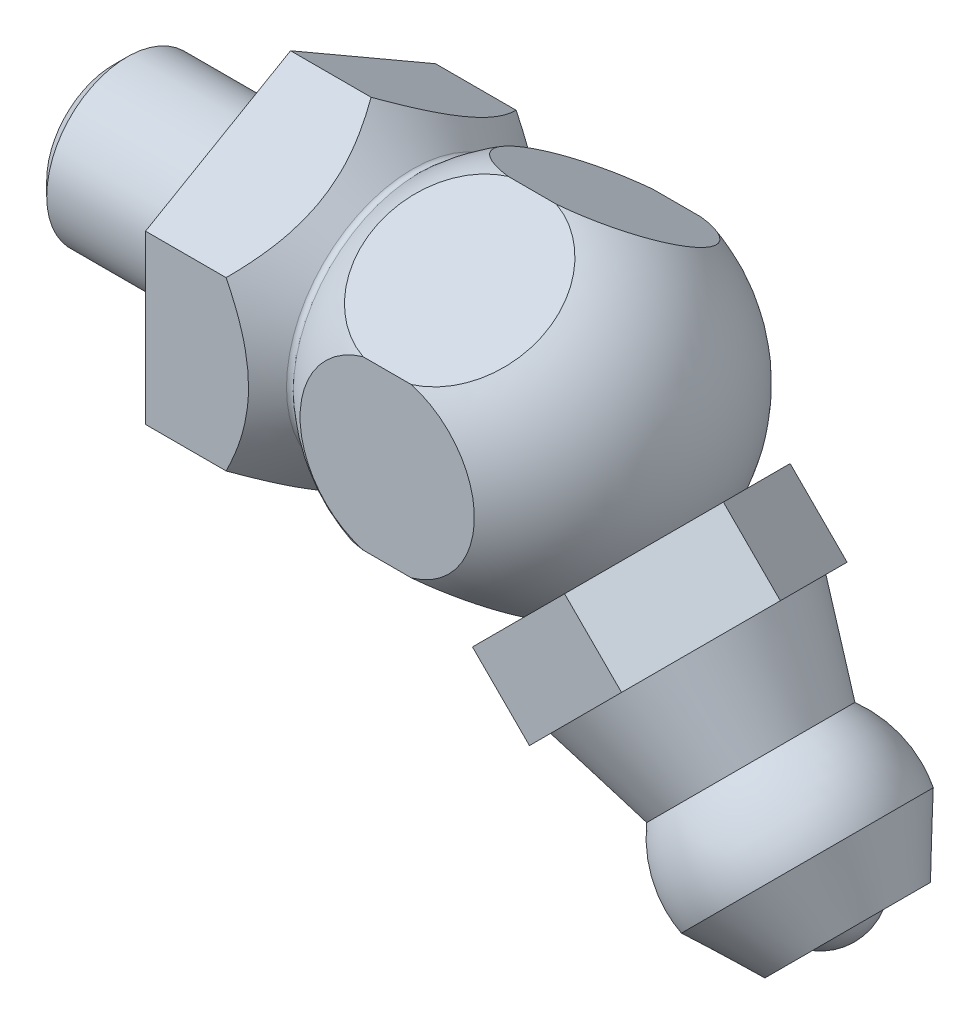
ISO-10303-21;
HEADER;
FILE_DESCRIPTION(('STEP AP214'),'2;1');
FILE_NAME('part.step','',(''),(''),'','','');
FILE_SCHEMA(('AUTOMOTIVE_DESIGN { 1 0 10303 214 1 1 1 1 }'));
ENDSEC;
DATA;
#1=APPLICATION_CONTEXT('core data for automotive mechanical design processes');
#2=APPLICATION_PROTOCOL_DEFINITION('international standard','automotive_design',2000,#1);
#3=PRODUCT_CONTEXT('',#1,'mechanical');
#4=PRODUCT('Part','Part','',(#3));
#5=PRODUCT_RELATED_PRODUCT_CATEGORY('part','',(#4));
#6=PRODUCT_DEFINITION_FORMATION('','',#4);
#7=PRODUCT_DEFINITION_CONTEXT('part definition',#1,'design');
#8=PRODUCT_DEFINITION('design','',#6,#7);
#9=PRODUCT_DEFINITION_SHAPE('','',#8);
#10=(LENGTH_UNIT() NAMED_UNIT(*) SI_UNIT(.MILLI.,.METRE.));
#11=(NAMED_UNIT(*) PLANE_ANGLE_UNIT() SI_UNIT($,.RADIAN.));
#12=(NAMED_UNIT(*) SI_UNIT($,.STERADIAN.) SOLID_ANGLE_UNIT());
#13=UNCERTAINTY_MEASURE_WITH_UNIT(LENGTH_MEASURE(1.E-05),#10,'distance_accuracy_value','');
#14=(GEOMETRIC_REPRESENTATION_CONTEXT(3) GLOBAL_UNCERTAINTY_ASSIGNED_CONTEXT((#13)) GLOBAL_UNIT_ASSIGNED_CONTEXT((#10,
#11,#12)) REPRESENTATION_CONTEXT('',''));
#15=CARTESIAN_POINT('',(0.,0.,0.));
#16=DIRECTION('',(0.,0.,1.));
#17=DIRECTION('',(1.,0.,0.));
#18=AXIS2_PLACEMENT_3D('',#15,#16,#17);
#19=CARTESIAN_POINT('',(7.5,0.,0.));
#20=DIRECTION('',(-1.,0.,0.));
#21=DIRECTION('',(0.,1.,0.));
#22=AXIS2_PLACEMENT_3D('',#19,#20,#21);
#23=SPHERICAL_SURFACE('',#22,5.25);
#24=CARTESIAN_POINT('',(7.5,-3.89711431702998,2.25));
#25=DIRECTION('',(0.,0.866025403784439,-0.5));
#26=DIRECTION('',(0.,0.5,0.866025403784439));
#27=AXIS2_PLACEMENT_3D('',#24,#25,#26);
#28=CIRCLE('',#27,2.70416345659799);
#29=CARTESIAN_POINT('',(8.25,-2.59807621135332,4.5));
#30=VERTEX_POINT('',#29);
#31=CARTESIAN_POINT('',(10.1090626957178,-3.54169489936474,2.86560448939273));
#32=VERTEX_POINT('',#31);
#33=EDGE_CURVE('E426',#30,#32,#28,.T.);
#34=ORIENTED_EDGE('',*,*,#33,.T.);
#35=CARTESIAN_POINT('',(10.5753787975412,-3.07537879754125,0.));
#36=DIRECTION('',(-0.707106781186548,0.707106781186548,0.));
#37=DIRECTION('',(-0.707106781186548,-0.707106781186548,0.));
#38=AXIS2_PLACEMENT_3D('',#35,#36,#37);
#39=CIRCLE('',#38,2.94050854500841);
#40=CARTESIAN_POINT('',(10.1090626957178,-3.54169489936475,-2.86560448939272));
#41=VERTEX_POINT('',#40);
#42=EDGE_CURVE('E212',#32,#41,#39,.T.);
#43=ORIENTED_EDGE('',*,*,#42,.T.);
#44=CARTESIAN_POINT('',(7.5,-3.89711431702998,-2.25));
#45=DIRECTION('',(0.,0.866025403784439,0.5));
#46=DIRECTION('',(0.,-0.5,0.866025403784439));
#47=AXIS2_PLACEMENT_3D('',#44,#45,#46);
#48=CIRCLE('',#47,2.70416345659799);
#49=CARTESIAN_POINT('',(8.25,-2.59807621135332,-4.5));
#50=VERTEX_POINT('',#49);
#51=EDGE_CURVE('E287',#41,#50,#48,.T.);
#52=ORIENTED_EDGE('',*,*,#51,.T.);
#53=CARTESIAN_POINT('',(7.5,0.,-4.5));
#54=DIRECTION('',(0.,0.,1.));
#55=DIRECTION('',(0.,-1.,0.));
#56=AXIS2_PLACEMENT_3D('',#53,#54,#55);
#57=CIRCLE('',#56,2.70416345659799);
#58=CARTESIAN_POINT('',(8.25,2.59807621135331,-4.5));
#59=VERTEX_POINT('',#58);
#60=EDGE_CURVE('E273',#50,#59,#57,.T.);
#61=ORIENTED_EDGE('',*,*,#60,.T.);
#62=CARTESIAN_POINT('',(7.5,3.89711431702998,-2.25));
#63=DIRECTION('',(0.,-0.866025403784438,0.5));
#64=DIRECTION('',(0.,-0.5,-0.866025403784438));
#65=AXIS2_PLACEMENT_3D('',#62,#63,#64);
#66=CIRCLE('',#65,2.70416345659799);
#67=CARTESIAN_POINT('',(8.25,5.19615242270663,0.));
#68=VERTEX_POINT('',#67);
#69=EDGE_CURVE('E38',#59,#68,#66,.T.);
#70=ORIENTED_EDGE('',*,*,#69,.T.);
#71=CARTESIAN_POINT('',(7.5,3.89711431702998,2.25));
#72=DIRECTION('',(0.,-0.866025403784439,-0.5));
#73=DIRECTION('',(0.,0.5,-0.866025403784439));
#74=AXIS2_PLACEMENT_3D('',#71,#72,#73);
#75=CIRCLE('',#74,2.70416345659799);
#76=CARTESIAN_POINT('',(8.25,2.59807621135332,4.5));
#77=VERTEX_POINT('',#76);
#78=EDGE_CURVE('E357',#68,#77,#75,.T.);
#79=ORIENTED_EDGE('',*,*,#78,.T.);
#80=CARTESIAN_POINT('',(7.5,0.,4.5));
#81=DIRECTION('',(0.,0.,-1.));
#82=DIRECTION('',(0.,1.,0.));
#83=AXIS2_PLACEMENT_3D('',#80,#81,#82);
#84=CIRCLE('',#83,2.70416345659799);
#85=EDGE_CURVE('E333',#77,#30,#84,.T.);
#86=ORIENTED_EDGE('',*,*,#85,.T.);
#87=EDGE_LOOP('',(#34,#43,#52,#61,#70,#79,#86));
#88=FACE_BOUND('',#87,.T.);
#89=ADVANCED_FACE('F15',(#88),#23,.T.);
#90=CARTESIAN_POINT('',(8.25,-5.19615242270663,0.));
#91=VERTEX_POINT('',#90);
#92=CARTESIAN_POINT('',(8.49676654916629,-5.15399104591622,-0.0730256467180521));
#93=VERTEX_POINT('',#92);
#94=EDGE_CURVE('E282',#91,#93,#48,.T.);
#95=ORIENTED_EDGE('',*,*,#94,.T.);
#96=CARTESIAN_POINT('',(8.49676654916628,-5.15399104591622,0.0730256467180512));
#97=VERTEX_POINT('',#96);
#98=EDGE_CURVE('E31',#93,#97,#39,.T.);
#99=ORIENTED_EDGE('',*,*,#98,.T.);
#100=EDGE_CURVE('E424',#97,#91,#28,.T.);
#101=ORIENTED_EDGE('',*,*,#100,.T.);
#102=EDGE_LOOP('',(#95,#99,#101));
#103=FACE_BOUND('',#102,.T.);
#104=ADVANCED_FACE('F458',(#103),#23,.T.);
#105=CARTESIAN_POINT('',(6.75,2.59807621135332,4.5));
#106=VERTEX_POINT('',#105);
#107=CARTESIAN_POINT('',(6.75,5.19615242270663,0.));
#108=VERTEX_POINT('',#107);
#109=EDGE_CURVE('E358',#106,#108,#75,.T.);
#110=ORIENTED_EDGE('',*,*,#109,.T.);
#111=CARTESIAN_POINT('',(6.75,2.59807621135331,-4.5));
#112=VERTEX_POINT('',#111);
#113=EDGE_CURVE('E220',#108,#112,#66,.T.);
#114=ORIENTED_EDGE('',*,*,#113,.T.);
#115=CARTESIAN_POINT('',(6.75,-2.59807621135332,-4.5));
#116=VERTEX_POINT('',#115);
#117=EDGE_CURVE('E272',#112,#116,#57,.T.);
#118=ORIENTED_EDGE('',*,*,#117,.T.);
#119=CARTESIAN_POINT('',(6.75,-5.19615242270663,0.));
#120=VERTEX_POINT('',#119);
#121=EDGE_CURVE('E281',#116,#120,#48,.T.);
#122=ORIENTED_EDGE('',*,*,#121,.T.);
#123=CARTESIAN_POINT('',(6.75,-2.59807621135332,4.5));
#124=VERTEX_POINT('',#123);
#125=EDGE_CURVE('E415',#120,#124,#28,.T.);
#126=ORIENTED_EDGE('',*,*,#125,.T.);
#127=EDGE_CURVE('E438',#124,#106,#84,.T.);
#128=ORIENTED_EDGE('',*,*,#127,.T.);
#129=EDGE_LOOP('',(#110,#114,#118,#122,#126,#128));
#130=FACE_BOUND('',#129,.T.);
#131=CARTESIAN_POINT('',(3.99147025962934,0.,0.));
#132=DIRECTION('',(-1.,0.,0.));
#133=DIRECTION('',(0.,0.,1.));
#134=AXIS2_PLACEMENT_3D('',#131,#132,#133);
#135=CIRCLE('',#134,3.90547296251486);
#136=CARTESIAN_POINT('',(3.99147025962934,0.,3.90547296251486));
#137=VERTEX_POINT('',#136);
#138=EDGE_CURVE('E378',#137,#137,#135,.T.);
#139=ORIENTED_EDGE('',*,*,#138,.F.);
#140=EDGE_LOOP('',(#139));
#141=FACE_BOUND('',#140,.T.);
#142=ADVANCED_FACE('F17',(#130,#141),#23,.T.);
#143=CARTESIAN_POINT('',(3.89122655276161,0.,0.));
#144=DIRECTION('',(-1.,0.,0.));
#145=DIRECTION('',(0.,0.,1.));
#146=AXIS2_PLACEMENT_3D('',#143,#144,#145);
#147=TOROIDAL_SURFACE('',#146,4.017057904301,0.15);
#148=ORIENTED_EDGE('',*,*,#138,.T.);
#149=EDGE_LOOP('',(#148));
#150=FACE_BOUND('',#149,.T.);
#151=CARTESIAN_POINT('',(3.78516053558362,0.,0.));
#152=DIRECTION('',(-1.,0.,0.));
#153=DIRECTION('',(0.,0.,1.));
#154=AXIS2_PLACEMENT_3D('',#151,#152,#153);
#155=CIRCLE('',#154,3.91099188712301);
#156=CARTESIAN_POINT('',(3.78516053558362,0.,3.91099188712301));
#157=VERTEX_POINT('',#156);
#158=EDGE_CURVE('E374',#157,#157,#155,.T.);
#159=ORIENTED_EDGE('',*,*,#158,.F.);
#160=EDGE_LOOP('',(#159));
#161=FACE_BOUND('',#160,.T.);
#162=ADVANCED_FACE('F464',(#150,#161),#147,.F.);
#163=CARTESIAN_POINT('',(2.5,0.,0.));
#164=DIRECTION('',(-1.,0.,0.));
#165=DIRECTION('',(0.,0.,1.));
#166=AXIS2_PLACEMENT_3D('',#163,#164,#165);
#167=CONICAL_SURFACE('',#166,5.19615242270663,0.785398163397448);
#168=CARTESIAN_POINT('',(2.499998,5.19615442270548,3.4640996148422E-06));
#169=CARTESIAN_POINT('',(2.54466103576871,5.15148473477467,-0.0773667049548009));
#170=CARTESIAN_POINT('',(2.58795334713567,5.10647170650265,-0.155331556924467));
#171=CARTESIAN_POINT('',(2.67137958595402,5.01569162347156,-0.312567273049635));
#172=CARTESIAN_POINT('',(2.71151178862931,4.96992417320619,-0.391838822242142));
#173=CARTESIAN_POINT('',(2.82688498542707,4.83096407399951,-0.632524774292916));
#174=CARTESIAN_POINT('',(2.8966104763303,4.73659513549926,-0.7959765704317));
#175=CARTESIAN_POINT('',(3.01601019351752,4.54629268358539,-1.12559008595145));
#176=CARTESIAN_POINT('',(3.06598519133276,4.45040779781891,-1.29166757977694));
#177=CARTESIAN_POINT('',(3.12379369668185,4.30500427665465,-1.54351386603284));
#178=CARTESIAN_POINT('',(3.14019647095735,4.25632238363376,-1.62783337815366));
#179=CARTESIAN_POINT('',(3.16691288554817,4.15854645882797,-1.79718624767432));
#180=CARTESIAN_POINT('',(3.17722743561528,4.10945248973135,-1.88221949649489));
#181=CARTESIAN_POINT('',(3.19452170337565,3.98981307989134,-2.08944103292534));
#182=CARTESIAN_POINT('',(3.19814986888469,3.91913872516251,-2.21185260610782));
#183=CARTESIAN_POINT('',(3.19205689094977,3.77791744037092,-2.45645504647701));
#184=CARTESIAN_POINT('',(3.18233106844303,3.70737056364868,-2.57864582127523));
#185=CARTESIAN_POINT('',(3.15010341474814,3.5669419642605,-2.82187529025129));
#186=CARTESIAN_POINT('',(3.12758729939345,3.49706107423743,-2.94291254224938));
#187=CARTESIAN_POINT('',(3.07100316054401,3.35850039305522,-3.18290668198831));
#188=CARTESIAN_POINT('',(3.03693602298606,3.28982051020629,-3.30186372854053));
#189=CARTESIAN_POINT('',(2.96685446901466,3.16790964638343,-3.51301953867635));
#190=CARTESIAN_POINT('',(2.93268420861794,3.11440855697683,-3.60568614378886));
#191=CARTESIAN_POINT('',(2.85883804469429,3.00836663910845,-3.78935613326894));
#192=CARTESIAN_POINT('',(2.81916197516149,2.95582583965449,-3.88035946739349));
#193=CARTESIAN_POINT('',(2.73519338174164,2.85187000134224,-4.06041626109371));
#194=CARTESIAN_POINT('',(2.69091537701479,2.8004520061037,-4.1494748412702));
#195=CARTESIAN_POINT('',(2.59832404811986,2.69856798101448,-4.32594314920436));
#196=CARTESIAN_POINT('',(2.55001319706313,2.64810139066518,-4.4133538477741));
#197=CARTESIAN_POINT('',(2.49999884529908,2.59807505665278,-4.500002));
#198=B_SPLINE_CURVE_WITH_KNOTS('',3,(#168,#169,#170,#171,#172,#173,#174,#175,#176,#177,#178,
#179,#180,#181,#182,#183,#184,#185,#186,#187,#188,#189,#190,#191,#192,#193,#194,#195,#196,#197),
.UNSPECIFIED.,.F.,.F.,(4,2,2,2,2,2,2,2,2,2,2,2,2,2,4),(0.,0.299626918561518,0.599416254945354,
1.20223089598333,1.79547485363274,2.09151514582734,2.3875111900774,2.81103790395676,
3.23471305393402,3.65886229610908,4.08297901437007,4.41979820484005,4.75662755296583,
5.09242472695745,5.42801746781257),.UNSPECIFIED.);
#199=CARTESIAN_POINT('',(2.49999999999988,5.19615242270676,2.09672024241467E-13));
#200=VERTEX_POINT('',#199);
#201=CARTESIAN_POINT('',(2.5,2.59807621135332,-4.5));
#202=VERTEX_POINT('',#201);
#203=EDGE_CURVE('E228',#200,#202,#198,.T.);
#204=ORIENTED_EDGE('',*,*,#203,.F.);
#205=CARTESIAN_POINT('',(2.499998,2.59807421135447,4.50000346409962));
#206=CARTESIAN_POINT('',(2.54466103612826,2.64274389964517,4.42263329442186));
#207=CARTESIAN_POINT('',(2.58795334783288,2.68775692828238,4.34466844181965));
#208=CARTESIAN_POINT('',(2.6713795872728,2.77853701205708,4.18743272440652));
#209=CARTESIAN_POINT('',(2.71151179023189,2.82430446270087,4.10816117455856));
#210=CARTESIAN_POINT('',(2.8268849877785,2.96326456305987,3.86747522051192));
#211=CARTESIAN_POINT('',(2.89661047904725,3.05763350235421,3.70402342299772));
#212=CARTESIAN_POINT('',(3.01601019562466,3.24793595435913,3.37440990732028));
#213=CARTESIAN_POINT('',(3.06598519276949,3.34382083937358,3.20833241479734));
#214=CARTESIAN_POINT('',(3.12379369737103,3.4892243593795,2.95648613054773));
#215=CARTESIAN_POINT('',(3.14019647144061,3.53790625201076,2.87216661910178));
#216=CARTESIAN_POINT('',(3.16691288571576,3.63568217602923,2.7028137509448));
#217=CARTESIAN_POINT('',(3.17722743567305,3.68477614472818,2.61778050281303));
#218=CARTESIAN_POINT('',(3.19452170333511,3.80441555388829,2.41055896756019));
#219=CARTESIAN_POINT('',(3.19814986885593,3.875089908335,2.28814739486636));
#220=CARTESIAN_POINT('',(3.19205689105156,4.01631119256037,2.04354495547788));
#221=CARTESIAN_POINT('',(3.18233106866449,4.08685806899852,1.92135418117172));
#222=CARTESIAN_POINT('',(3.15010341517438,4.2272866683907,1.67812471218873));
#223=CARTESIAN_POINT('',(3.12758729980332,4.29716755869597,1.55708745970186));
#224=CARTESIAN_POINT('',(3.07100316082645,4.43572824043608,1.31709331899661));
#225=CARTESIAN_POINT('',(3.03693602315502,4.50440812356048,1.19813627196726));
#226=CARTESIAN_POINT('',(2.96685442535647,4.62631906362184,0.986980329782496));
#227=CARTESIAN_POINT('',(2.93268411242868,4.67982022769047,0.894313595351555));
#228=CARTESIAN_POINT('',(2.85883782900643,4.7858622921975,0.710643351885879));
#229=CARTESIAN_POINT('',(2.81916169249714,4.83840316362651,0.61963989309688));
#230=CARTESIAN_POINT('',(2.73519295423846,4.94235914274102,0.439582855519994));
#231=CARTESIAN_POINT('',(2.69091487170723,4.99377720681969,0.350524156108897));
#232=CARTESIAN_POINT('',(2.59832337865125,5.09566136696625,0.17405561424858));
#233=CARTESIAN_POINT('',(2.55001244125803,5.14612802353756,0.0866448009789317));
#234=CARTESIAN_POINT('',(2.499998,5.19615442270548,-3.46409961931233E-06));
#235=B_SPLINE_CURVE_WITH_KNOTS('',3,(#205,#206,#207,#208,#209,#210,#211,#212,#213,#214,#215,
#216,#217,#218,#219,#220,#221,#222,#223,#224,#225,#226,#227,#228,#229,#230,#231,#232,#233,#234),
.UNSPECIFIED.,.F.,.F.,(4,2,2,2,2,2,2,2,2,2,2,2,2,2,4),(0.,0.299626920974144,0.599416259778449,
1.20223090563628,1.79547485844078,2.0915151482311,2.38751119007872,2.8110379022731,
3.23471305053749,3.65886229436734,4.0829790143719,4.4197986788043,4.75662850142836,
5.09242614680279,5.42801935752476),.UNSPECIFIED.);
#236=CARTESIAN_POINT('',(2.5,2.59807621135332,4.5));
#237=VERTEX_POINT('',#236);
#238=EDGE_CURVE('E346',#237,#200,#235,.T.);
#239=ORIENTED_EDGE('',*,*,#238,.F.);
#240=CARTESIAN_POINT('',(-1.45485826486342,-7.96812378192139,4.5));
#241=CARTESIAN_POINT('',(-1.28869375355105,-7.77725517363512,4.5));
#242=CARTESIAN_POINT('',(-1.1233118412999,-7.58569726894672,4.5));
#243=CARTESIAN_POINT('',(-0.794537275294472,-7.20083140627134,4.5));
#244=CARTESIAN_POINT('',(-0.631144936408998,-7.00752317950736,4.5));
#245=CARTESIAN_POINT('',(-0.305739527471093,-6.61754282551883,4.5));
#246=CARTESIAN_POINT('',(-0.143743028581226,-6.42085683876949,4.5));
#247=CARTESIAN_POINT('',(0.177083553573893,-6.02493702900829,4.5));
#248=CARTESIAN_POINT('',(0.335913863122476,-5.8257033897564,4.5));
#249=CARTESIAN_POINT('',(0.66230234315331,-5.40772425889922,4.5));
#250=CARTESIAN_POINT('',(0.829518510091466,-5.1887106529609,4.5));
#251=CARTESIAN_POINT('',(1.15767633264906,-4.74592442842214,4.5));
#252=CARTESIAN_POINT('',(1.31861651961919,-4.52215071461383,4.5));
#253=CARTESIAN_POINT('',(1.63135833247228,-4.06921563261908,4.5));
#254=CARTESIAN_POINT('',(1.78318485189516,-3.84007156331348,4.5));
#255=CARTESIAN_POINT('',(2.07459012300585,-3.37417678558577,4.5));
#256=CARTESIAN_POINT('',(2.2141759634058,-3.13743058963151,4.5));
#257=CARTESIAN_POINT('',(2.43178162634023,-2.73527818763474,4.5));
#258=CARTESIAN_POINT('',(2.51475232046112,-2.57256574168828,4.5));
#259=CARTESIAN_POINT('',(2.67057257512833,-2.24224886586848,4.5));
#260=CARTESIAN_POINT('',(2.74341944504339,-2.0746431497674,4.5));
#261=CARTESIAN_POINT('',(2.87520845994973,-1.73649389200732,4.5));
#262=CARTESIAN_POINT('',(2.93431932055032,-1.56601702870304,4.5));
#263=CARTESIAN_POINT('',(3.0365403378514,-1.22031200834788,4.5));
#264=CARTESIAN_POINT('',(3.07965929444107,-1.04508652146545,4.5));
#265=CARTESIAN_POINT('',(3.13829719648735,-0.735522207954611,4.5));
#266=CARTESIAN_POINT('',(3.15802989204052,-0.601981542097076,4.5));
#267=CARTESIAN_POINT('',(3.18576796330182,-0.333688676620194,4.5));
#268=CARTESIAN_POINT('',(3.19377569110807,-0.19893672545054,4.5));
#269=CARTESIAN_POINT('',(3.19761516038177,0.070668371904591,4.5));
#270=CARTESIAN_POINT('',(3.19345365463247,0.205521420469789,4.5));
#271=CARTESIAN_POINT('',(3.17320972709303,0.474334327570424,4.5));
#272=CARTESIAN_POINT('',(3.15712506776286,0.608294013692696,4.5));
#273=CARTESIAN_POINT('',(3.10806847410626,0.910056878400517,4.5));
#274=CARTESIAN_POINT('',(3.07172679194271,1.07731216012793,4.5));
#275=CARTESIAN_POINT('',(2.98379657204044,1.40774085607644,4.5));
#276=CARTESIAN_POINT('',(2.93220131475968,1.57091243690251,4.5));
#277=CARTESIAN_POINT('',(2.81578475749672,1.89504915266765,4.5));
#278=CARTESIAN_POINT('',(2.75078499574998,2.05594943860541,4.5));
#279=CARTESIAN_POINT('',(2.64572744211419,2.2938718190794,4.5));
#280=CARTESIAN_POINT('',(2.60945179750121,2.3726018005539,4.5));
#281=CARTESIAN_POINT('',(2.53465428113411,2.52898752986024,4.5));
#282=CARTESIAN_POINT('',(2.49613245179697,2.60664329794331,4.5));
#283=CARTESIAN_POINT('',(2.38648020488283,2.82072066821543,4.5));
#284=CARTESIAN_POINT('',(2.31321311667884,2.95604877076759,4.5));
#285=CARTESIAN_POINT('',(2.1616197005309,3.22385377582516,4.5));
#286=CARTESIAN_POINT('',(2.08329235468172,3.35633009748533,4.5));
#287=CARTESIAN_POINT('',(1.92247755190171,3.61885290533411,4.5));
#288=CARTESIAN_POINT('',(1.83998720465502,3.74889761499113,4.5));
#289=CARTESIAN_POINT('',(1.67163238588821,4.00678946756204,4.5));
#290=CARTESIAN_POINT('',(1.58576765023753,4.13463643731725,4.5));
#291=CARTESIAN_POINT('',(1.32330763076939,4.51636346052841,4.5));
#292=CARTESIAN_POINT('',(1.14251641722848,4.76735794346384,4.5));
#293=CARTESIAN_POINT('',(0.773264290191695,5.26342980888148,4.5));
#294=CARTESIAN_POINT('',(0.584806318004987,5.5085094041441,4.5));
#295=CARTESIAN_POINT('',(0.219834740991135,5.97191439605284,4.5));
#296=CARTESIAN_POINT('',(0.0438141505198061,6.19062941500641,4.5));
#297=CARTESIAN_POINT('',(-0.31179879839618,6.62516814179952,4.5));
#298=CARTESIAN_POINT('',(-0.491391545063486,6.84099153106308,4.5));
#299=CARTESIAN_POINT('',(-0.85165352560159,7.26829396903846,4.5));
#300=CARTESIAN_POINT('',(-1.03229702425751,7.47979476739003,4.5));
#301=CARTESIAN_POINT('',(-1.39574054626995,7.9008620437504,4.5));
#302=CARTESIAN_POINT('',(-1.57854012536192,8.11042890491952,4.5));
#303=CARTESIAN_POINT('',(-1.76217480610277,8.31925200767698,4.5));
#304=B_SPLINE_CURVE_WITH_KNOTS('',3,(#240,#241,#242,#243,#244,#245,#246,#247,#248,#249,#250,
#251,#252,#253,#254,#255,#256,#257,#258,#259,#260,#261,#262,#263,#264,#265,#266,#267,#268,#269,
#270,#271,#272,#273,#274,#275,#276,#277,#278,#279,#280,#281,#282,#283,#284,#285,#286,#287,#288,
#289,#290,#291,#292,#293,#294,#295,#296,#297,#298,#299,#300,#301,#302,#303),.UNSPECIFIED.,.F.,
.F.,(4,2,2,2,2,2,2,2,2,2,2,2,2,2,2,2,2,2,2,2,2,2,2,2,2,2,2,2,2,2,2,4),(0.,0.759199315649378,
1.51851725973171,2.28292165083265,3.04727121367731,3.87384097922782,4.70060302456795,
5.52499311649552,6.34890259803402,6.89657776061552,7.44439820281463,7.98508487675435,
8.52547358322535,8.92998027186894,9.334405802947,9.73860695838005,10.142883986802,
10.6554692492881,11.168280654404,11.6884200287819,11.9484482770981,12.2084716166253,
12.66999204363,13.1316055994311,13.593544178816,14.0555189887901,14.9832563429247,
15.91064107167,16.7528376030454,17.5951261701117,18.4295451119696,19.2637950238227),.UNSPECIFIED.);
#305=CARTESIAN_POINT('',(2.5,-2.59807621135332,4.5));
#306=VERTEX_POINT('',#305);
#307=EDGE_CURVE('E325',#306,#237,#304,.T.);
#308=ORIENTED_EDGE('',*,*,#307,.F.);
#309=CARTESIAN_POINT('',(2.499998,-5.19615442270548,-3.46409961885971E-06));
#310=CARTESIAN_POINT('',(2.54466103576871,-5.15148473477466,0.0773667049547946));
#311=CARTESIAN_POINT('',(2.58795334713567,-5.10647170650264,0.15533155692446));
#312=CARTESIAN_POINT('',(2.67137958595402,-5.01569162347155,0.312567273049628));
#313=CARTESIAN_POINT('',(2.71151178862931,-4.96992417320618,0.391838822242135));
#314=CARTESIAN_POINT('',(2.82688498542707,-4.83096407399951,0.632524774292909));
#315=CARTESIAN_POINT('',(2.89661047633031,-4.73659513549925,0.795976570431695));
#316=CARTESIAN_POINT('',(3.01601019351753,-4.54629268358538,1.12559008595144));
#317=CARTESIAN_POINT('',(3.06598519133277,-4.4504077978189,1.29166757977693));
#318=CARTESIAN_POINT('',(3.12379369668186,-4.30500427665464,1.54351386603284));
#319=CARTESIAN_POINT('',(3.14019647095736,-4.25632238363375,1.62783337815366));
#320=CARTESIAN_POINT('',(3.16691288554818,-4.15854645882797,1.79718624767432));
#321=CARTESIAN_POINT('',(3.17722743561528,-4.10945248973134,1.88221949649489));
#322=CARTESIAN_POINT('',(3.19452170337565,-3.98981307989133,2.08944103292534));
#323=CARTESIAN_POINT('',(3.1981498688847,-3.9191387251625,2.21185260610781));
#324=CARTESIAN_POINT('',(3.19205689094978,-3.77791744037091,2.45645504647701));
#325=CARTESIAN_POINT('',(3.18233106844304,-3.70737056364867,2.57864582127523));
#326=CARTESIAN_POINT('',(3.15010341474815,-3.56694196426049,2.82187529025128));
#327=CARTESIAN_POINT('',(3.12758729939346,-3.49706107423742,2.94291254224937));
#328=CARTESIAN_POINT('',(3.07100316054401,-3.35850039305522,3.1829066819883));
#329=CARTESIAN_POINT('',(3.03693602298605,-3.2898205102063,3.30186372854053));
#330=CARTESIAN_POINT('',(2.96685446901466,-3.16790964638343,3.51301953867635));
#331=CARTESIAN_POINT('',(2.93268420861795,-3.11440855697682,3.60568614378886));
#332=CARTESIAN_POINT('',(2.85883804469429,-3.00836663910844,3.78935613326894));
#333=CARTESIAN_POINT('',(2.8191619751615,-2.95582583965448,3.88035946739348));
#334=CARTESIAN_POINT('',(2.73519338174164,-2.85187000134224,4.06041626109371));
#335=CARTESIAN_POINT('',(2.69091537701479,-2.8004520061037,4.1494748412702));
#336=CARTESIAN_POINT('',(2.59832404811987,-2.69856798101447,4.32594314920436));
#337=CARTESIAN_POINT('',(2.55001319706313,-2.64810139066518,4.4133538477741));
#338=CARTESIAN_POINT('',(2.49999884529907,-2.59807505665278,4.500002));
#339=B_SPLINE_CURVE_WITH_KNOTS('',3,(#309,#310,#311,#312,#313,#314,#315,#316,#317,#318,#319,
#320,#321,#322,#323,#324,#325,#326,#327,#328,#329,#330,#331,#332,#333,#334,#335,#336,#337,#338),
.UNSPECIFIED.,.F.,.F.,(4,2,2,2,2,2,2,2,2,2,2,2,2,2,4),(0.,0.29962691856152,0.599416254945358,
1.20223089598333,1.79547485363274,2.09151514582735,2.38751119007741,2.81103790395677,
3.23471305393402,3.65886229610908,4.08297901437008,4.41979820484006,4.75662755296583,
5.09242472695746,5.42801746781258),.UNSPECIFIED.);
#340=CARTESIAN_POINT('',(2.5,-5.19615242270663,0.));
#341=VERTEX_POINT('',#340);
#342=EDGE_CURVE('E301',#341,#306,#339,.T.);
#343=ORIENTED_EDGE('',*,*,#342,.F.);
#344=CARTESIAN_POINT('',(2.499998,-2.59807421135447,-4.50000346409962));
#345=CARTESIAN_POINT('',(2.54466103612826,-2.64274389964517,-4.42263329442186));
#346=CARTESIAN_POINT('',(2.58795334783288,-2.68775692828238,-4.34466844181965));
#347=CARTESIAN_POINT('',(2.6713795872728,-2.77853701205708,-4.18743272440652));
#348=CARTESIAN_POINT('',(2.71151179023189,-2.82430446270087,-4.10816117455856));
#349=CARTESIAN_POINT('',(2.8268849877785,-2.96326456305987,-3.86747522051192));
#350=CARTESIAN_POINT('',(2.89661047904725,-3.05763350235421,-3.70402342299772));
#351=CARTESIAN_POINT('',(3.01601019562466,-3.24793595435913,-3.37440990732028));
#352=CARTESIAN_POINT('',(3.06598519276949,-3.34382083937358,-3.20833241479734));
#353=CARTESIAN_POINT('',(3.12379369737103,-3.4892243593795,-2.95648613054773));
#354=CARTESIAN_POINT('',(3.14019647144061,-3.53790625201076,-2.87216661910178));
#355=CARTESIAN_POINT('',(3.16691288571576,-3.63568217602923,-2.7028137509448));
#356=CARTESIAN_POINT('',(3.17722743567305,-3.68477614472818,-2.61778050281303));
#357=CARTESIAN_POINT('',(3.19452170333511,-3.80441555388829,-2.41055896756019));
#358=CARTESIAN_POINT('',(3.19814986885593,-3.875089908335,-2.28814739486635));
#359=CARTESIAN_POINT('',(3.19205689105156,-4.01631119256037,-2.04354495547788));
#360=CARTESIAN_POINT('',(3.18233106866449,-4.08685806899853,-1.92135418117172));
#361=CARTESIAN_POINT('',(3.15010341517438,-4.22728666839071,-1.67812471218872));
#362=CARTESIAN_POINT('',(3.12758729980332,-4.29716755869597,-1.55708745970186));
#363=CARTESIAN_POINT('',(3.07100316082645,-4.43572824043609,-1.3170933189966));
#364=CARTESIAN_POINT('',(3.03693602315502,-4.50440812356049,-1.19813627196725));
#365=CARTESIAN_POINT('',(2.96685442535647,-4.62631906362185,-0.986980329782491));
#366=CARTESIAN_POINT('',(2.93268411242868,-4.67982022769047,-0.894313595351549));
#367=CARTESIAN_POINT('',(2.85883782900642,-4.7858622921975,-0.710643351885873));
#368=CARTESIAN_POINT('',(2.81916169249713,-4.83840316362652,-0.619639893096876));
#369=CARTESIAN_POINT('',(2.73519295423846,-4.94235914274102,-0.439582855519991));
#370=CARTESIAN_POINT('',(2.69091487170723,-4.99377720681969,-0.350524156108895));
#371=CARTESIAN_POINT('',(2.59832337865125,-5.09566136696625,-0.174055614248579));
#372=CARTESIAN_POINT('',(2.55001244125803,-5.14612802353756,-0.0866448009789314));
#373=CARTESIAN_POINT('',(2.499998,-5.19615442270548,3.46409961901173E-06));
#374=B_SPLINE_CURVE_WITH_KNOTS('',3,(#344,#345,#346,#347,#348,#349,#350,#351,#352,#353,#354,
#355,#356,#357,#358,#359,#360,#361,#362,#363,#364,#365,#366,#367,#368,#369,#370,#371,#372,#373),
.UNSPECIFIED.,.F.,.F.,(4,2,2,2,2,2,2,2,2,2,2,2,2,2,4),(0.,0.299626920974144,0.599416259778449,
1.20223090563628,1.79547485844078,2.0915151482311,2.38751119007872,2.8110379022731,
3.2347130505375,3.65886229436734,4.08297901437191,4.41979867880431,4.75662850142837,
5.09242614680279,5.42801935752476),.UNSPECIFIED.);
#375=CARTESIAN_POINT('',(2.5,-2.59807621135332,-4.5));
#376=VERTEX_POINT('',#375);
#377=EDGE_CURVE('E286',#376,#341,#374,.T.);
#378=ORIENTED_EDGE('',*,*,#377,.F.);
#379=CARTESIAN_POINT('',(-1.45485826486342,-7.9681237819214,-4.5));
#380=CARTESIAN_POINT('',(-1.28869375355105,-7.77725517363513,-4.5));
#381=CARTESIAN_POINT('',(-1.1233118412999,-7.58569726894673,-4.5));
#382=CARTESIAN_POINT('',(-0.794537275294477,-7.20083140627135,-4.5));
#383=CARTESIAN_POINT('',(-0.631144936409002,-7.00752317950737,-4.5));
#384=CARTESIAN_POINT('',(-0.305739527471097,-6.61754282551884,-4.5));
#385=CARTESIAN_POINT('',(-0.143743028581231,-6.42085683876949,-4.5));
#386=CARTESIAN_POINT('',(0.177083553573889,-6.0249370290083,-4.5));
#387=CARTESIAN_POINT('',(0.335913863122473,-5.82570338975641,-4.5));
#388=CARTESIAN_POINT('',(0.662302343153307,-5.40772425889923,-4.5));
#389=CARTESIAN_POINT('',(0.829518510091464,-5.1887106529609,-4.5));
#390=CARTESIAN_POINT('',(1.15767633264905,-4.74592442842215,-4.5));
#391=CARTESIAN_POINT('',(1.31861651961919,-4.52215071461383,-4.5));
#392=CARTESIAN_POINT('',(1.63135833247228,-4.06921563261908,-4.5));
#393=CARTESIAN_POINT('',(1.78318485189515,-3.84007156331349,-4.5));
#394=CARTESIAN_POINT('',(2.07459012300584,-3.37417678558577,-4.5));
#395=CARTESIAN_POINT('',(2.2141759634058,-3.13743058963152,-4.5));
#396=CARTESIAN_POINT('',(2.43178162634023,-2.73527818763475,-4.5));
#397=CARTESIAN_POINT('',(2.51475232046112,-2.57256574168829,-4.5));
#398=CARTESIAN_POINT('',(2.67057257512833,-2.24224886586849,-4.5));
#399=CARTESIAN_POINT('',(2.74341944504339,-2.07464314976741,-4.5));
#400=CARTESIAN_POINT('',(2.87520845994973,-1.73649389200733,-4.5));
#401=CARTESIAN_POINT('',(2.93431932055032,-1.56601702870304,-4.5));
#402=CARTESIAN_POINT('',(3.0365403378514,-1.22031200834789,-4.5));
#403=CARTESIAN_POINT('',(3.07965929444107,-1.04508652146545,-4.5));
#404=CARTESIAN_POINT('',(3.13829719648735,-0.735522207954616,-4.5));
#405=CARTESIAN_POINT('',(3.15802989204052,-0.601981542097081,-4.5));
#406=CARTESIAN_POINT('',(3.18576796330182,-0.333688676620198,-4.5));
#407=CARTESIAN_POINT('',(3.19377569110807,-0.198936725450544,-4.5));
#408=CARTESIAN_POINT('',(3.19761516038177,0.070668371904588,-4.5));
#409=CARTESIAN_POINT('',(3.19345365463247,0.205521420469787,-4.5));
#410=CARTESIAN_POINT('',(3.17320972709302,0.474334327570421,-4.5));
#411=CARTESIAN_POINT('',(3.15712506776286,0.608294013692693,-4.5));
#412=CARTESIAN_POINT('',(3.10806847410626,0.910056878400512,-4.5));
#413=CARTESIAN_POINT('',(3.07172679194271,1.07731216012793,-4.5));
#414=CARTESIAN_POINT('',(2.98379657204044,1.40774085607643,-4.5));
#415=CARTESIAN_POINT('',(2.93220131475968,1.57091243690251,-4.5));
#416=CARTESIAN_POINT('',(2.81578475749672,1.89504915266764,-4.5));
#417=CARTESIAN_POINT('',(2.75078499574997,2.0559494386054,-4.5));
#418=CARTESIAN_POINT('',(2.64572744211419,2.2938718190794,-4.5));
#419=CARTESIAN_POINT('',(2.60945179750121,2.37260180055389,-4.5));
#420=CARTESIAN_POINT('',(2.53465428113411,2.52898752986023,-4.5));
#421=CARTESIAN_POINT('',(2.49613245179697,2.6066432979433,-4.5));
#422=CARTESIAN_POINT('',(2.38648020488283,2.82072066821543,-4.5));
#423=CARTESIAN_POINT('',(2.31321311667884,2.95604877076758,-4.5));
#424=CARTESIAN_POINT('',(2.1616197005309,3.22385377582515,-4.50000000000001));
#425=CARTESIAN_POINT('',(2.08329235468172,3.35633009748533,-4.5));
#426=CARTESIAN_POINT('',(1.92247755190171,3.6188529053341,-4.5));
#427=CARTESIAN_POINT('',(1.83998720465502,3.74889761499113,-4.5));
#428=CARTESIAN_POINT('',(1.67163238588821,4.00678946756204,-4.5));
#429=CARTESIAN_POINT('',(1.58576765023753,4.13463643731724,-4.5));
#430=CARTESIAN_POINT('',(1.32330763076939,4.5163634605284,-4.5));
#431=CARTESIAN_POINT('',(1.14251641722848,4.76735794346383,-4.50000000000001));
#432=CARTESIAN_POINT('',(0.773264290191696,5.26342980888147,-4.50000000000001));
#433=CARTESIAN_POINT('',(0.584806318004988,5.50850940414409,-4.50000000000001));
#434=CARTESIAN_POINT('',(0.219834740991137,5.97191439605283,-4.50000000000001));
#435=CARTESIAN_POINT('',(0.0438141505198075,6.1906294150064,-4.50000000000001));
#436=CARTESIAN_POINT('',(-0.311798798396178,6.62516814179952,-4.50000000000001));
#437=CARTESIAN_POINT('',(-0.491391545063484,6.84099153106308,-4.50000000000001));
#438=CARTESIAN_POINT('',(-0.851653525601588,7.26829396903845,-4.50000000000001));
#439=CARTESIAN_POINT('',(-1.03229702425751,7.47979476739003,-4.50000000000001));
#440=CARTESIAN_POINT('',(-1.39574054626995,7.9008620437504,-4.50000000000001));
#441=CARTESIAN_POINT('',(-1.57854012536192,8.11042890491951,-4.5));
#442=CARTESIAN_POINT('',(-1.76217480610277,8.31925200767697,-4.5));
#443=B_SPLINE_CURVE_WITH_KNOTS('',3,(#379,#380,#381,#382,#383,#384,#385,#386,#387,#388,#389,
#390,#391,#392,#393,#394,#395,#396,#397,#398,#399,#400,#401,#402,#403,#404,#405,#406,#407,#408,
#409,#410,#411,#412,#413,#414,#415,#416,#417,#418,#419,#420,#421,#422,#423,#424,#425,#426,#427,
#428,#429,#430,#431,#432,#433,#434,#435,#436,#437,#438,#439,#440,#441,#442),.UNSPECIFIED.,.F.,
.F.,(4,2,2,2,2,2,2,2,2,2,2,2,2,2,2,2,2,2,2,2,2,2,2,2,2,2,2,2,2,2,2,4),(0.,0.759199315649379,
1.51851725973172,2.28292165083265,3.04727121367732,3.87384097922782,4.70060302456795,
5.52499311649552,6.34890259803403,6.89657776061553,7.44439820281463,7.98508487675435,
8.52547358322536,8.92998027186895,9.33440580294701,9.73860695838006,10.1428839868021,
10.6554692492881,11.168280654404,11.6884200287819,11.9484482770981,12.2084716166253,
12.66999204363,13.1316055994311,13.593544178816,14.0555189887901,14.9832563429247,
15.91064107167,16.7528376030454,17.5951261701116,18.4295451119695,19.2637950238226),.UNSPECIFIED.);
#444=EDGE_CURVE('E258',#202,#376,#443,.F.);
#445=ORIENTED_EDGE('',*,*,#444,.F.);
#446=EDGE_LOOP('',(#204,#239,#308,#343,#378,#445));
#447=FACE_BOUND('',#446,.T.);
#448=ORIENTED_EDGE('',*,*,#158,.T.);
#449=EDGE_LOOP('',(#448));
#450=FACE_BOUND('',#449,.T.);
#451=ADVANCED_FACE('F238',(#447,#450),#167,.T.);
#452=CARTESIAN_POINT('',(0.,2.5,0.));
#453=DIRECTION('',(-1.,0.,0.));
#454=DIRECTION('',(0.,0.,1.));
#455=AXIS2_PLACEMENT_3D('',#452,#453,#454);
#456=PLANE('',#455);
#457=DIRECTION('',(0.,0.5,0.866025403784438));
#458=VECTOR('',#457,1.);
#459=CARTESIAN_POINT('',(0.,1.64711431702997,-6.14711431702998));
#460=LINE('',#459,#458);
#461=CARTESIAN_POINT('',(0.,2.59807621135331,-4.5));
#462=VERTEX_POINT('',#461);
#463=CARTESIAN_POINT('',(0.,5.19615242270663,0.));
#464=VERTEX_POINT('',#463);
#465=EDGE_CURVE('E217',#462,#464,#460,.T.);
#466=ORIENTED_EDGE('',*,*,#465,.F.);
#467=DIRECTION('',(0.,1.,0.));
#468=VECTOR('',#467,1.);
#469=CARTESIAN_POINT('',(0.,-4.5,-4.5));
#470=LINE('',#469,#468);
#471=CARTESIAN_POINT('',(0.,-2.59807621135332,-4.5));
#472=VERTEX_POINT('',#471);
#473=EDGE_CURVE('E236',#472,#462,#470,.T.);
#474=ORIENTED_EDGE('',*,*,#473,.F.);
#475=DIRECTION('',(0.,0.5,-0.866025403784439));
#476=VECTOR('',#475,1.);
#477=CARTESIAN_POINT('',(0.,-6.14711431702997,1.64711431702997));
#478=LINE('',#477,#476);
#479=CARTESIAN_POINT('',(0.,-5.19615242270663,0.));
#480=VERTEX_POINT('',#479);
#481=EDGE_CURVE('E277',#480,#472,#478,.T.);
#482=ORIENTED_EDGE('',*,*,#481,.F.);
#483=DIRECTION('',(0.,-0.5,-0.866025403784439));
#484=VECTOR('',#483,1.);
#485=CARTESIAN_POINT('',(0.,-1.64711431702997,6.14711431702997));
#486=LINE('',#485,#484);
#487=CARTESIAN_POINT('',(0.,-2.59807621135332,4.5));
#488=VERTEX_POINT('',#487);
#489=EDGE_CURVE('E297',#488,#480,#486,.T.);
#490=ORIENTED_EDGE('',*,*,#489,.F.);
#491=DIRECTION('',(0.,-1.,0.));
#492=VECTOR('',#491,1.);
#493=CARTESIAN_POINT('',(0.,4.5,4.5));
#494=LINE('',#493,#492);
#495=CARTESIAN_POINT('',(0.,2.59807621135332,4.5));
#496=VERTEX_POINT('',#495);
#497=EDGE_CURVE('E432',#496,#488,#494,.T.);
#498=ORIENTED_EDGE('',*,*,#497,.F.);
#499=DIRECTION('',(0.,-0.5,0.866025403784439));
#500=VECTOR('',#499,1.);
#501=CARTESIAN_POINT('',(0.,6.14711431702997,-1.64711431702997));
#502=LINE('',#501,#500);
#503=EDGE_CURVE('E338',#464,#496,#502,.T.);
#504=ORIENTED_EDGE('',*,*,#503,.F.);
#505=EDGE_LOOP('',(#466,#474,#482,#490,#498,#504));
#506=FACE_BOUND('',#505,.T.);
#507=CARTESIAN_POINT('',(0.,0.,0.));
#508=DIRECTION('',(-1.,0.,0.));
#509=DIRECTION('',(0.,0.,1.));
#510=AXIS2_PLACEMENT_3D('',#507,#508,#509);
#511=CIRCLE('',#510,2.5);
#512=CARTESIAN_POINT('',(0.,0.,2.5));
#513=VERTEX_POINT('',#512);
#514=EDGE_CURVE('E370',#513,#513,#511,.T.);
#515=ORIENTED_EDGE('',*,*,#514,.F.);
#516=EDGE_LOOP('',(#515));
#517=FACE_BOUND('',#516,.T.);
#518=ADVANCED_FACE('F472',(#506,#517),#456,.T.);
#519=CARTESIAN_POINT('',(0.,0.,0.));
#520=DIRECTION('',(-1.,0.,0.));
#521=DIRECTION('',(0.,0.,1.));
#522=AXIS2_PLACEMENT_3D('',#519,#520,#521);
#523=CYLINDRICAL_SURFACE('',#522,2.5);
#524=ORIENTED_EDGE('',*,*,#514,.T.);
#525=EDGE_LOOP('',(#524));
#526=FACE_BOUND('',#525,.T.);
#527=CARTESIAN_POINT('',(-5.0669872,0.,0.));
#528=DIRECTION('',(-1.,0.,0.));
#529=DIRECTION('',(0.,0.,1.));
#530=AXIS2_PLACEMENT_3D('',#527,#528,#529);
#531=CIRCLE('',#530,2.5);
#532=CARTESIAN_POINT('',(-5.0669872,0.,2.5));
#533=VERTEX_POINT('',#532);
#534=EDGE_CURVE('E366',#533,#533,#531,.T.);
#535=ORIENTED_EDGE('',*,*,#534,.F.);
#536=EDGE_LOOP('',(#535));
#537=FACE_BOUND('',#536,.T.);
#538=ADVANCED_FACE('F481',(#526,#537),#523,.T.);
#539=CARTESIAN_POINT('',(-5.5,0.,0.));
#540=DIRECTION('',(1.,0.,0.));
#541=DIRECTION('',(0.,0.,-1.));
#542=AXIS2_PLACEMENT_3D('',#539,#540,#541);
#543=CONICAL_SURFACE('',#542,2.0669872,0.785398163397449);
#544=ORIENTED_EDGE('',*,*,#534,.T.);
#545=EDGE_LOOP('',(#544));
#546=FACE_BOUND('',#545,.T.);
#547=CARTESIAN_POINT('',(-5.5,0.,0.));
#548=DIRECTION('',(-1.,0.,0.));
#549=DIRECTION('',(0.,0.,1.));
#550=AXIS2_PLACEMENT_3D('',#547,#548,#549);
#551=CIRCLE('',#550,2.0669872);
#552=CARTESIAN_POINT('',(-5.5,0.,2.0669872));
#553=VERTEX_POINT('',#552);
#554=EDGE_CURVE('E362',#553,#553,#551,.T.);
#555=ORIENTED_EDGE('',*,*,#554,.F.);
#556=EDGE_LOOP('',(#555));
#557=FACE_BOUND('',#556,.T.);
#558=ADVANCED_FACE('F557',(#546,#557),#543,.T.);
#559=CARTESIAN_POINT('',(-5.5,0.,0.));
#560=DIRECTION('',(-1.,0.,0.));
#561=DIRECTION('',(0.,0.,1.));
#562=AXIS2_PLACEMENT_3D('',#559,#560,#561);
#563=PLANE('',#562);
#564=ORIENTED_EDGE('',*,*,#554,.T.);
#565=EDGE_LOOP('',(#564));
#566=FACE_BOUND('',#565,.T.);
#567=ADVANCED_FACE('F567',(#566),#563,.T.);
#568=CARTESIAN_POINT('',(11.75,6.14711431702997,-1.64711431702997));
#569=DIRECTION('',(0.,-0.866025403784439,-0.5));
#570=DIRECTION('',(0.,0.5,-0.866025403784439));
#571=AXIS2_PLACEMENT_3D('',#568,#569,#570);
#572=PLANE('',#571);
#573=DIRECTION('',(-1.,0.,0.));
#574=VECTOR('',#573,1.);
#575=CARTESIAN_POINT('',(0.,2.59807621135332,4.5));
#576=LINE('',#575,#574);
#577=EDGE_CURVE('E353',#496,#237,#576,.F.);
#578=ORIENTED_EDGE('',*,*,#577,.T.);
#579=ORIENTED_EDGE('',*,*,#238,.T.);
#580=DIRECTION('',(-1.,0.,0.));
#581=VECTOR('',#580,1.);
#582=CARTESIAN_POINT('',(0.,5.19615242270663,0.));
#583=LINE('',#582,#581);
#584=EDGE_CURVE('E342',#200,#464,#583,.T.);
#585=ORIENTED_EDGE('',*,*,#584,.T.);
#586=ORIENTED_EDGE('',*,*,#503,.T.);
#587=EDGE_LOOP('',(#578,#579,#585,#586));
#588=FACE_BOUND('',#587,.T.);
#589=ADVANCED_FACE('F321',(#588),#572,.F.);
#590=ORIENTED_EDGE('',*,*,#78,.F.);
#591=DIRECTION('',(-1.,0.,0.));
#592=VECTOR('',#591,1.);
#593=CARTESIAN_POINT('',(11.75,5.19615242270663,0.));
#594=LINE('',#593,#592);
#595=EDGE_CURVE('E224',#68,#108,#594,.T.);
#596=ORIENTED_EDGE('',*,*,#595,.T.);
#597=ORIENTED_EDGE('',*,*,#109,.F.);
#598=DIRECTION('',(1.,0.,0.));
#599=VECTOR('',#598,1.);
#600=CARTESIAN_POINT('',(11.75,2.59807621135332,4.5));
#601=LINE('',#600,#599);
#602=EDGE_CURVE('E382',#106,#77,#601,.T.);
#603=ORIENTED_EDGE('',*,*,#602,.T.);
#604=EDGE_LOOP('',(#590,#596,#597,#603));
#605=FACE_BOUND('',#604,.T.);
#606=ADVANCED_FACE('F451',(#605),#572,.F.);
#607=CARTESIAN_POINT('',(11.75,4.5,4.5));
#608=DIRECTION('',(0.,0.,-1.));
#609=DIRECTION('',(0.,1.,0.));
#610=AXIS2_PLACEMENT_3D('',#607,#608,#609);
#611=PLANE('',#610);
#612=ORIENTED_EDGE('',*,*,#127,.F.);
#613=DIRECTION('',(1.,0.,0.));
#614=VECTOR('',#613,1.);
#615=CARTESIAN_POINT('',(11.75,-2.59807621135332,4.5));
#616=LINE('',#615,#614);
#617=EDGE_CURVE('E422',#124,#30,#616,.T.);
#618=ORIENTED_EDGE('',*,*,#617,.T.);
#619=ORIENTED_EDGE('',*,*,#85,.F.);
#620=ORIENTED_EDGE('',*,*,#602,.F.);
#621=EDGE_LOOP('',(#612,#618,#619,#620));
#622=FACE_BOUND('',#621,.T.);
#623=ADVANCED_FACE('F319',(#622),#611,.F.);
#624=DIRECTION('',(-1.,0.,0.));
#625=VECTOR('',#624,1.);
#626=CARTESIAN_POINT('',(0.,-2.59807621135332,4.5));
#627=LINE('',#626,#625);
#628=EDGE_CURVE('E332',#488,#306,#627,.F.);
#629=ORIENTED_EDGE('',*,*,#628,.T.);
#630=ORIENTED_EDGE('',*,*,#307,.T.);
#631=ORIENTED_EDGE('',*,*,#577,.F.);
#632=ORIENTED_EDGE('',*,*,#497,.T.);
#633=EDGE_LOOP('',(#629,#630,#631,#632));
#634=FACE_BOUND('',#633,.T.);
#635=ADVANCED_FACE('F314',(#634),#611,.F.);
#636=CARTESIAN_POINT('',(11.75,-1.64711431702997,6.14711431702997));
#637=DIRECTION('',(0.,0.866025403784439,-0.5));
#638=DIRECTION('',(0.,0.5,0.866025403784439));
#639=AXIS2_PLACEMENT_3D('',#636,#637,#638);
#640=PLANE('',#639);
#641=DIRECTION('',(-1.,0.,0.));
#642=VECTOR('',#641,1.);
#643=CARTESIAN_POINT('',(0.,-5.19615242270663,0.));
#644=LINE('',#643,#642);
#645=EDGE_CURVE('E307',#480,#341,#644,.F.);
#646=ORIENTED_EDGE('',*,*,#645,.T.);
#647=ORIENTED_EDGE('',*,*,#342,.T.);
#648=ORIENTED_EDGE('',*,*,#628,.F.);
#649=ORIENTED_EDGE('',*,*,#489,.T.);
#650=EDGE_LOOP('',(#646,#647,#648,#649));
#651=FACE_BOUND('',#650,.T.);
#652=ADVANCED_FACE('F309',(#651),#640,.F.);
#653=ORIENTED_EDGE('',*,*,#100,.F.);
#654=DIRECTION('',(0.447213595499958,0.447213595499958,0.774596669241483));
#655=VECTOR('',#654,1.);
#656=CARTESIAN_POINT('',(11.952914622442,-1.69784297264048,6.05924970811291));
#657=LINE('',#656,#655);
#658=EDGE_CURVE('E213',#97,#32,#657,.T.);
#659=ORIENTED_EDGE('',*,*,#658,.T.);
#660=ORIENTED_EDGE('',*,*,#33,.F.);
#661=ORIENTED_EDGE('',*,*,#617,.F.);
#662=ORIENTED_EDGE('',*,*,#125,.F.);
#663=DIRECTION('',(1.,0.,0.));
#664=VECTOR('',#663,1.);
#665=CARTESIAN_POINT('',(11.75,-5.19615242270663,0.));
#666=LINE('',#665,#664);
#667=EDGE_CURVE('E386',#120,#91,#666,.T.);
#668=ORIENTED_EDGE('',*,*,#667,.T.);
#669=EDGE_LOOP('',(#653,#659,#660,#661,#662,#668));
#670=FACE_BOUND('',#669,.T.);
#671=ADVANCED_FACE('F313',(#670),#640,.F.);
#672=CARTESIAN_POINT('',(11.75,-6.14711431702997,1.64711431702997));
#673=DIRECTION('',(0.,0.866025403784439,0.5));
#674=DIRECTION('',(0.,-0.5,0.866025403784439));
#675=AXIS2_PLACEMENT_3D('',#672,#673,#674);
#676=PLANE('',#675);
#677=ORIENTED_EDGE('',*,*,#51,.F.);
#678=DIRECTION('',(-0.447213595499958,-0.447213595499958,0.774596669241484));
#679=VECTOR('',#678,1.);
#680=CARTESIAN_POINT('',(8.35291462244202,-5.29784297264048,0.176133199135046));
#681=LINE('',#680,#679);
#682=EDGE_CURVE('E9',#41,#93,#681,.T.);
#683=ORIENTED_EDGE('',*,*,#682,.T.);
#684=ORIENTED_EDGE('',*,*,#94,.F.);
#685=ORIENTED_EDGE('',*,*,#667,.F.);
#686=ORIENTED_EDGE('',*,*,#121,.F.);
#687=DIRECTION('',(1.,0.,0.));
#688=VECTOR('',#687,1.);
#689=CARTESIAN_POINT('',(11.75,-2.59807621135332,-4.5));
#690=LINE('',#689,#688);
#691=EDGE_CURVE('E268',#116,#50,#690,.T.);
#692=ORIENTED_EDGE('',*,*,#691,.T.);
#693=EDGE_LOOP('',(#677,#683,#684,#685,#686,#692));
#694=FACE_BOUND('',#693,.T.);
#695=ADVANCED_FACE('F418',(#694),#676,.F.);
#696=DIRECTION('',(-1.,0.,0.));
#697=VECTOR('',#696,1.);
#698=CARTESIAN_POINT('',(0.,-2.59807621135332,-4.5));
#699=LINE('',#698,#697);
#700=EDGE_CURVE('E293',#472,#376,#699,.F.);
#701=ORIENTED_EDGE('',*,*,#700,.T.);
#702=ORIENTED_EDGE('',*,*,#377,.T.);
#703=ORIENTED_EDGE('',*,*,#645,.F.);
#704=ORIENTED_EDGE('',*,*,#481,.T.);
#705=EDGE_LOOP('',(#701,#702,#703,#704));
#706=FACE_BOUND('',#705,.T.);
#707=ADVANCED_FACE('F254',(#706),#676,.F.);
#708=CARTESIAN_POINT('',(11.75,-4.5,-4.5));
#709=DIRECTION('',(0.,0.,1.));
#710=DIRECTION('',(0.,-1.,0.));
#711=AXIS2_PLACEMENT_3D('',#708,#709,#710);
#712=PLANE('',#711);
#713=DIRECTION('',(-1.,0.,0.));
#714=VECTOR('',#713,1.);
#715=CARTESIAN_POINT('',(0.,2.59807621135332,-4.5));
#716=LINE('',#715,#714);
#717=EDGE_CURVE('E264',#462,#202,#716,.F.);
#718=ORIENTED_EDGE('',*,*,#717,.T.);
#719=ORIENTED_EDGE('',*,*,#444,.T.);
#720=ORIENTED_EDGE('',*,*,#700,.F.);
#721=ORIENTED_EDGE('',*,*,#473,.T.);
#722=EDGE_LOOP('',(#718,#719,#720,#721));
#723=FACE_BOUND('',#722,.T.);
#724=ADVANCED_FACE('F249',(#723),#712,.F.);
#725=ORIENTED_EDGE('',*,*,#117,.F.);
#726=DIRECTION('',(1.,0.,0.));
#727=VECTOR('',#726,1.);
#728=CARTESIAN_POINT('',(11.75,2.59807621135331,-4.5));
#729=LINE('',#728,#727);
#730=EDGE_CURVE('E24',#112,#59,#729,.T.);
#731=ORIENTED_EDGE('',*,*,#730,.T.);
#732=ORIENTED_EDGE('',*,*,#60,.F.);
#733=ORIENTED_EDGE('',*,*,#691,.F.);
#734=EDGE_LOOP('',(#725,#731,#732,#733));
#735=FACE_BOUND('',#734,.T.);
#736=ADVANCED_FACE('F253',(#735),#712,.F.);
#737=CARTESIAN_POINT('',(11.75,1.64711431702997,-6.14711431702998));
#738=DIRECTION('',(0.,-0.866025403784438,0.5));
#739=DIRECTION('',(0.,-0.5,-0.866025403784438));
#740=AXIS2_PLACEMENT_3D('',#737,#738,#739);
#741=PLANE('',#740);
#742=ORIENTED_EDGE('',*,*,#69,.F.);
#743=ORIENTED_EDGE('',*,*,#730,.F.);
#744=ORIENTED_EDGE('',*,*,#113,.F.);
#745=ORIENTED_EDGE('',*,*,#595,.F.);
#746=EDGE_LOOP('',(#742,#743,#744,#745));
#747=FACE_BOUND('',#746,.T.);
#748=ADVANCED_FACE('F246',(#747),#741,.F.);
#749=ORIENTED_EDGE('',*,*,#203,.T.);
#750=ORIENTED_EDGE('',*,*,#717,.F.);
#751=ORIENTED_EDGE('',*,*,#465,.T.);
#752=ORIENTED_EDGE('',*,*,#584,.F.);
#753=EDGE_LOOP('',(#749,#750,#751,#752));
#754=FACE_BOUND('',#753,.T.);
#755=ADVANCED_FACE('F241',(#754),#741,.F.);
#756=CARTESIAN_POINT('',(10.5753787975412,-3.07537879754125,0.));
#757=DIRECTION('',(-0.707106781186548,0.707106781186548,0.));
#758=DIRECTION('',(0.,0.,1.));
#759=AXIS2_PLACEMENT_3D('',#756,#757,#758);
#760=PLANE('',#759);
#761=DIRECTION('',(0.353553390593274,0.353553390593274,-0.866025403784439));
#762=VECTOR('',#761,1.);
#763=CARTESIAN_POINT('',(7.71764076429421,-5.93311683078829,0.));
#764=LINE('',#763,#762);
#765=CARTESIAN_POINT('',(7.71764076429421,-5.93311683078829,0.));
#766=VERTEX_POINT('',#765);
#767=CARTESIAN_POINT('',(9.14650978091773,-4.50424781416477,-3.5));
#768=VERTEX_POINT('',#767);
#769=EDGE_CURVE('E164',#766,#768,#764,.T.);
#770=ORIENTED_EDGE('',*,*,#769,.F.);
#771=DIRECTION('',(-0.353553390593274,-0.353553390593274,-0.866025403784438));
#772=VECTOR('',#771,1.);
#773=CARTESIAN_POINT('',(9.14650978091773,-4.50424781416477,3.5));
#774=LINE('',#773,#772);
#775=CARTESIAN_POINT('',(9.14650978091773,-4.50424781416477,3.5));
#776=VERTEX_POINT('',#775);
#777=EDGE_CURVE('E153',#776,#766,#774,.T.);
#778=ORIENTED_EDGE('',*,*,#777,.F.);
#779=DIRECTION('',(-0.707106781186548,-0.707106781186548,0.));
#780=VECTOR('',#779,1.);
#781=CARTESIAN_POINT('',(12.0042478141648,-1.64650978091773,3.5));
#782=LINE('',#781,#780);
#783=CARTESIAN_POINT('',(12.0042478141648,-1.64650978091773,3.5));
#784=VERTEX_POINT('',#783);
#785=EDGE_CURVE('E807',#784,#776,#782,.T.);
#786=ORIENTED_EDGE('',*,*,#785,.F.);
#787=DIRECTION('',(-0.353553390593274,-0.353553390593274,0.866025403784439));
#788=VECTOR('',#787,1.);
#789=CARTESIAN_POINT('',(13.4331168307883,-0.217640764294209,0.));
#790=LINE('',#789,#788);
#791=CARTESIAN_POINT('',(13.4331168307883,-0.217640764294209,0.));
#792=VERTEX_POINT('',#791);
#793=EDGE_CURVE('E802',#792,#784,#790,.T.);
#794=ORIENTED_EDGE('',*,*,#793,.F.);
#795=DIRECTION('',(0.353553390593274,0.353553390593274,0.866025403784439));
#796=VECTOR('',#795,1.);
#797=CARTESIAN_POINT('',(12.0042478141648,-1.64650978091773,-3.5));
#798=LINE('',#797,#796);
#799=CARTESIAN_POINT('',(12.0042478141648,-1.64650978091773,-3.5));
#800=VERTEX_POINT('',#799);
#801=EDGE_CURVE('E798',#800,#792,#798,.T.);
#802=ORIENTED_EDGE('',*,*,#801,.F.);
#803=DIRECTION('',(0.707106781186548,0.707106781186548,0.));
#804=VECTOR('',#803,1.);
#805=CARTESIAN_POINT('',(9.14650978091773,-4.50424781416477,-3.5));
#806=LINE('',#805,#804);
#807=EDGE_CURVE('E169',#768,#800,#806,.T.);
#808=ORIENTED_EDGE('',*,*,#807,.F.);
#809=EDGE_LOOP('',(#770,#778,#786,#794,#802,#808));
#810=FACE_BOUND('',#809,.T.);
#811=ORIENTED_EDGE('',*,*,#658,.F.);
#812=ORIENTED_EDGE('',*,*,#98,.F.);
#813=ORIENTED_EDGE('',*,*,#682,.F.);
#814=ORIENTED_EDGE('',*,*,#42,.F.);
#815=EDGE_LOOP('',(#811,#812,#813,#814));
#816=FACE_BOUND('',#815,.T.);
#817=ADVANCED_FACE('F167',(#810,#816),#760,.T.);
#818=CARTESIAN_POINT('',(16.4443650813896,-8.9443650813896,0.));
#819=DIRECTION('',(-0.707106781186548,0.707106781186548,0.));
#820=DIRECTION('',(0.707106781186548,0.707106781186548,0.));
#821=AXIS2_PLACEMENT_3D('',#818,#819,#820);
#822=SPHERICAL_SURFACE('',#821,1.5);
#823=CARTESIAN_POINT('',(17.2928932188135,-9.79289321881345,0.));
#824=DIRECTION('',(-0.707106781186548,0.707106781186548,0.));
#825=DIRECTION('',(0.,0.,1.));
#826=AXIS2_PLACEMENT_3D('',#823,#824,#825);
#827=CIRCLE('',#826,0.9);
#828=CARTESIAN_POINT('',(17.2928932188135,-9.79289321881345,0.9));
#829=VERTEX_POINT('',#828);
#830=EDGE_CURVE('E206',#829,#829,#827,.T.);
#831=ORIENTED_EDGE('',*,*,#830,.F.);
#832=EDGE_LOOP('',(#831));
#833=FACE_BOUND('',#832,.T.);
#834=ADVANCED_FACE('F660',(#833),#822,.T.);
#835=CARTESIAN_POINT('',(17.9292893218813,-9.15649711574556,0.));
#836=DIRECTION('',(-0.707106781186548,0.707106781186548,0.));
#837=DIRECTION('',(0.,0.,1.));
#838=AXIS2_PLACEMENT_3D('',#835,#836,#837);
#839=PLANE('',#838);
#840=CARTESIAN_POINT('',(17.2928932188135,-9.79289321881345,0.));
#841=DIRECTION('',(-0.707106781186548,0.707106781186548,0.));
#842=DIRECTION('',(0.,0.,1.));
#843=AXIS2_PLACEMENT_3D('',#840,#841,#842);
#844=CIRCLE('',#843,2.1);
#845=CARTESIAN_POINT('',(17.2928932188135,-9.79289321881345,2.1));
#846=VERTEX_POINT('',#845);
#847=EDGE_CURVE('E202',#846,#846,#844,.T.);
#848=ORIENTED_EDGE('',*,*,#847,.F.);
#849=EDGE_LOOP('',(#848));
#850=FACE_BOUND('',#849,.T.);
#851=ORIENTED_EDGE('',*,*,#830,.T.);
#852=EDGE_LOOP('',(#851));
#853=FACE_BOUND('',#852,.T.);
#854=ADVANCED_FACE('F668',(#850,#853),#839,.F.);
#855=CARTESIAN_POINT('',(17.2928932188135,-9.79289321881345,0.));
#856=DIRECTION('',(-0.707106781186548,0.707106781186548,0.));
#857=DIRECTION('',(0.,0.,1.));
#858=AXIS2_PLACEMENT_3D('',#855,#856,#857);
#859=CONICAL_SURFACE('',#858,2.1,0.554038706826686);
#860=CARTESIAN_POINT('',(16.0423669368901,-8.54236693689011,0.));
#861=DIRECTION('',(-0.707106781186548,0.707106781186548,0.));
#862=DIRECTION('',(0.,0.,1.));
#863=AXIS2_PLACEMENT_3D('',#860,#861,#862);
#864=CIRCLE('',#863,3.194135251);
#865=CARTESIAN_POINT('',(16.0423669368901,-8.54236693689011,3.194135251));
#866=VERTEX_POINT('',#865);
#867=EDGE_CURVE('E198',#866,#866,#864,.T.);
#868=ORIENTED_EDGE('',*,*,#867,.F.);
#869=EDGE_LOOP('',(#868));
#870=FACE_BOUND('',#869,.T.);
#871=ORIENTED_EDGE('',*,*,#847,.T.);
#872=EDGE_LOOP('',(#871));
#873=FACE_BOUND('',#872,.T.);
#874=ADVANCED_FACE('F678',(#870,#873),#859,.T.);
#875=CARTESIAN_POINT('',(15.6259665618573,-8.12596656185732,0.));
#876=DIRECTION('',(-0.707106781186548,0.707106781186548,0.));
#877=DIRECTION('',(0.,0.,1.));
#878=AXIS2_PLACEMENT_3D('',#875,#876,#877);
#879=DEGENERATE_TOROIDAL_SURFACE('',#878,0.00206897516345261,3.25,.F.);
#880=CARTESIAN_POINT('',(14.2876893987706,-6.78768939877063,0.));
#881=DIRECTION('',(-0.707106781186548,0.707106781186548,0.));
#882=DIRECTION('',(0.,0.,1.));
#883=AXIS2_PLACEMENT_3D('',#880,#881,#882);
#884=CIRCLE('',#883,2.64);
#885=CARTESIAN_POINT('',(14.2876893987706,-6.78768939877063,2.64));
#886=VERTEX_POINT('',#885);
#887=EDGE_CURVE('E188',#886,#886,#884,.T.);
#888=ORIENTED_EDGE('',*,*,#887,.F.);
#889=EDGE_LOOP('',(#888));
#890=FACE_BOUND('',#889,.T.);
#891=ORIENTED_EDGE('',*,*,#867,.T.);
#892=EDGE_LOOP('',(#891));
#893=FACE_BOUND('',#892,.T.);
#894=ADVANCED_FACE('F688',(#890,#893),#879,.F.);
#895=CARTESIAN_POINT('',(12.3431457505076,-4.84314575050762,0.));
#896=DIRECTION('',(-0.707106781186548,0.707106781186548,0.));
#897=DIRECTION('',(0.,0.,1.));
#898=AXIS2_PLACEMENT_3D('',#895,#896,#897);
#899=CONICAL_SURFACE('',#898,3.49,0.29977607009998);
#900=ORIENTED_EDGE('',*,*,#887,.T.);
#901=EDGE_LOOP('',(#900));
#902=FACE_BOUND('',#901,.T.);
#903=CARTESIAN_POINT('',(12.3431457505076,-4.84314575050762,0.));
#904=DIRECTION('',(-0.707106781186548,0.707106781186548,0.));
#905=DIRECTION('',(0.,0.,1.));
#906=AXIS2_PLACEMENT_3D('',#903,#904,#905);
#907=CIRCLE('',#906,3.49);
#908=CARTESIAN_POINT('',(12.3431457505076,-4.84314575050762,3.49));
#909=VERTEX_POINT('',#908);
#910=EDGE_CURVE('E179',#909,#909,#907,.T.);
#911=ORIENTED_EDGE('',*,*,#910,.F.);
#912=EDGE_LOOP('',(#911));
#913=FACE_BOUND('',#912,.T.);
#914=ADVANCED_FACE('F698',(#902,#913),#899,.T.);
#915=CARTESIAN_POINT('',(14.8180194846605,-2.3682720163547,0.));
#916=DIRECTION('',(0.707106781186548,-0.707106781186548,0.));
#917=DIRECTION('',(0.,0.,-1.));
#918=AXIS2_PLACEMENT_3D('',#915,#916,#917);
#919=PLANE('',#918);
#920=ORIENTED_EDGE('',*,*,#910,.T.);
#921=EDGE_LOOP('',(#920));
#922=FACE_BOUND('',#921,.T.);
#923=DIRECTION('',(-0.353553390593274,-0.353553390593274,0.866025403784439));
#924=VECTOR('',#923,1.);
#925=CARTESIAN_POINT('',(15.2008837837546,-1.98540771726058,0.));
#926=LINE('',#925,#924);
#927=CARTESIAN_POINT('',(15.2008837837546,-1.98540771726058,0.));
#928=VERTEX_POINT('',#927);
#929=CARTESIAN_POINT('',(13.7720147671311,-3.4142767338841,3.5));
#930=VERTEX_POINT('',#929);
#931=EDGE_CURVE('E820',#928,#930,#926,.T.);
#932=ORIENTED_EDGE('',*,*,#931,.T.);
#933=DIRECTION('',(-0.707106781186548,-0.707106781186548,0.));
#934=VECTOR('',#933,1.);
#935=CARTESIAN_POINT('',(13.7720147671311,-3.4142767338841,3.5));
#936=LINE('',#935,#934);
#937=CARTESIAN_POINT('',(10.9142767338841,-6.27201476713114,3.5));
#938=VERTEX_POINT('',#937);
#939=EDGE_CURVE('E790',#930,#938,#936,.T.);
#940=ORIENTED_EDGE('',*,*,#939,.T.);
#941=DIRECTION('',(-0.353553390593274,-0.353553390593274,-0.866025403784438));
#942=VECTOR('',#941,1.);
#943=CARTESIAN_POINT('',(10.9142767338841,-6.27201476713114,3.5));
#944=LINE('',#943,#942);
#945=CARTESIAN_POINT('',(9.48540771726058,-7.70088378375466,0.));
#946=VERTEX_POINT('',#945);
#947=EDGE_CURVE('E812',#938,#946,#944,.T.);
#948=ORIENTED_EDGE('',*,*,#947,.T.);
#949=DIRECTION('',(0.353553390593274,0.353553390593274,-0.866025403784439));
#950=VECTOR('',#949,1.);
#951=CARTESIAN_POINT('',(9.48540771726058,-7.70088378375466,0.));
#952=LINE('',#951,#950);
#953=CARTESIAN_POINT('',(10.9142767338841,-6.27201476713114,-3.5));
#954=VERTEX_POINT('',#953);
#955=EDGE_CURVE('E177',#946,#954,#952,.T.);
#956=ORIENTED_EDGE('',*,*,#955,.T.);
#957=DIRECTION('',(0.707106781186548,0.707106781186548,0.));
#958=VECTOR('',#957,1.);
#959=CARTESIAN_POINT('',(10.9142767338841,-6.27201476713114,-3.5));
#960=LINE('',#959,#958);
#961=CARTESIAN_POINT('',(13.7720147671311,-3.4142767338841,-3.5));
#962=VERTEX_POINT('',#961);
#963=EDGE_CURVE('E816',#954,#962,#960,.T.);
#964=ORIENTED_EDGE('',*,*,#963,.T.);
#965=DIRECTION('',(0.353553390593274,0.353553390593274,0.866025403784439));
#966=VECTOR('',#965,1.);
#967=CARTESIAN_POINT('',(13.7720147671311,-3.4142767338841,-3.5));
#968=LINE('',#967,#966);
#969=EDGE_CURVE('E799',#962,#928,#968,.T.);
#970=ORIENTED_EDGE('',*,*,#969,.T.);
#971=EDGE_LOOP('',(#932,#940,#948,#956,#964,#970));
#972=FACE_BOUND('',#971,.T.);
#973=ADVANCED_FACE('F708',(#922,#972),#919,.T.);
#974=CARTESIAN_POINT('',(10.9142767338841,-6.27201476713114,3.5));
#975=DIRECTION('',(0.612372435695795,0.612372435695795,-0.5));
#976=DIRECTION('',(0.353553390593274,0.353553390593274,0.866025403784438));
#977=AXIS2_PLACEMENT_3D('',#974,#975,#976);
#978=PLANE('',#977);
#979=ORIENTED_EDGE('',*,*,#777,.T.);
#980=DIRECTION('',(-0.707106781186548,0.707106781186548,0.));
#981=VECTOR('',#980,1.);
#982=CARTESIAN_POINT('',(9.48540771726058,-7.70088378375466,0.));
#983=LINE('',#982,#981);
#984=EDGE_CURVE('E158',#946,#766,#983,.T.);
#985=ORIENTED_EDGE('',*,*,#984,.F.);
#986=ORIENTED_EDGE('',*,*,#947,.F.);
#987=DIRECTION('',(-0.707106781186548,0.707106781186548,0.));
#988=VECTOR('',#987,1.);
#989=CARTESIAN_POINT('',(10.9142767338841,-6.27201476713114,3.5));
#990=LINE('',#989,#988);
#991=EDGE_CURVE('E160',#938,#776,#990,.T.);
#992=ORIENTED_EDGE('',*,*,#991,.T.);
#993=EDGE_LOOP('',(#979,#985,#986,#992));
#994=FACE_BOUND('',#993,.T.);
#995=ADVANCED_FACE('F155',(#994),#978,.F.);
#996=CARTESIAN_POINT('',(9.48540771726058,-7.70088378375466,0.));
#997=DIRECTION('',(0.612372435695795,0.612372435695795,0.5));
#998=DIRECTION('',(-0.353553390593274,-0.353553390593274,0.866025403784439));
#999=AXIS2_PLACEMENT_3D('',#996,#997,#998);
#1000=PLANE('',#999);
#1001=ORIENTED_EDGE('',*,*,#769,.T.);
#1002=DIRECTION('',(-0.707106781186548,0.707106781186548,0.));
#1003=VECTOR('',#1002,1.);
#1004=CARTESIAN_POINT('',(10.9142767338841,-6.27201476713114,-3.5));
#1005=LINE('',#1004,#1003);
#1006=EDGE_CURVE('E180',#954,#768,#1005,.T.);
#1007=ORIENTED_EDGE('',*,*,#1006,.F.);
#1008=ORIENTED_EDGE('',*,*,#955,.F.);
#1009=ORIENTED_EDGE('',*,*,#984,.T.);
#1010=EDGE_LOOP('',(#1001,#1007,#1008,#1009));
#1011=FACE_BOUND('',#1010,.T.);
#1012=ADVANCED_FACE('F176',(#1011),#1000,.F.);
#1013=CARTESIAN_POINT('',(10.9142767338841,-6.27201476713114,-3.5));
#1014=DIRECTION('',(0.,0.,1.));
#1015=DIRECTION('',(-0.707106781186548,-0.707106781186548,0.));
#1016=AXIS2_PLACEMENT_3D('',#1013,#1014,#1015);
#1017=PLANE('',#1016);
#1018=ORIENTED_EDGE('',*,*,#807,.T.);
#1019=DIRECTION('',(-0.707106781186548,0.707106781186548,0.));
#1020=VECTOR('',#1019,1.);
#1021=CARTESIAN_POINT('',(13.7720147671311,-3.4142767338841,-3.5));
#1022=LINE('',#1021,#1020);
#1023=EDGE_CURVE('E191',#962,#800,#1022,.T.);
#1024=ORIENTED_EDGE('',*,*,#1023,.F.);
#1025=ORIENTED_EDGE('',*,*,#963,.F.);
#1026=ORIENTED_EDGE('',*,*,#1006,.T.);
#1027=EDGE_LOOP('',(#1018,#1024,#1025,#1026));
#1028=FACE_BOUND('',#1027,.T.);
#1029=ADVANCED_FACE('F736',(#1028),#1017,.F.);
#1030=CARTESIAN_POINT('',(13.7720147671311,-3.4142767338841,-3.5));
#1031=DIRECTION('',(-0.612372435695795,-0.612372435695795,0.5));
#1032=DIRECTION('',(-0.353553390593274,-0.353553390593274,-0.866025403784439));
#1033=AXIS2_PLACEMENT_3D('',#1030,#1031,#1032);
#1034=PLANE('',#1033);
#1035=ORIENTED_EDGE('',*,*,#801,.T.);
#1036=DIRECTION('',(-0.707106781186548,0.707106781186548,0.));
#1037=VECTOR('',#1036,1.);
#1038=CARTESIAN_POINT('',(15.2008837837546,-1.98540771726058,0.));
#1039=LINE('',#1038,#1037);
#1040=EDGE_CURVE('E784',#928,#792,#1039,.T.);
#1041=ORIENTED_EDGE('',*,*,#1040,.F.);
#1042=ORIENTED_EDGE('',*,*,#969,.F.);
#1043=ORIENTED_EDGE('',*,*,#1023,.T.);
#1044=EDGE_LOOP('',(#1035,#1041,#1042,#1043));
#1045=FACE_BOUND('',#1044,.T.);
#1046=ADVANCED_FACE('F745',(#1045),#1034,.F.);
#1047=CARTESIAN_POINT('',(15.2008837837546,-1.98540771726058,0.));
#1048=DIRECTION('',(-0.612372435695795,-0.612372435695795,-0.5));
#1049=DIRECTION('',(0.353553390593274,0.353553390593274,-0.866025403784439));
#1050=AXIS2_PLACEMENT_3D('',#1047,#1048,#1049);
#1051=PLANE('',#1050);
#1052=ORIENTED_EDGE('',*,*,#793,.T.);
#1053=DIRECTION('',(-0.707106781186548,0.707106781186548,0.));
#1054=VECTOR('',#1053,1.);
#1055=CARTESIAN_POINT('',(13.7720147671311,-3.4142767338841,3.5));
#1056=LINE('',#1055,#1054);
#1057=EDGE_CURVE('E781',#930,#784,#1056,.T.);
#1058=ORIENTED_EDGE('',*,*,#1057,.F.);
#1059=ORIENTED_EDGE('',*,*,#931,.F.);
#1060=ORIENTED_EDGE('',*,*,#1040,.T.);
#1061=EDGE_LOOP('',(#1052,#1058,#1059,#1060));
#1062=FACE_BOUND('',#1061,.T.);
#1063=ADVANCED_FACE('F756',(#1062),#1051,.F.);
#1064=CARTESIAN_POINT('',(13.7720147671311,-3.4142767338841,3.5));
#1065=DIRECTION('',(0.,0.,-1.));
#1066=DIRECTION('',(0.707106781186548,0.707106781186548,0.));
#1067=AXIS2_PLACEMENT_3D('',#1064,#1065,#1066);
#1068=PLANE('',#1067);
#1069=ORIENTED_EDGE('',*,*,#785,.T.);
#1070=ORIENTED_EDGE('',*,*,#991,.F.);
#1071=ORIENTED_EDGE('',*,*,#939,.F.);
#1072=ORIENTED_EDGE('',*,*,#1057,.T.);
#1073=EDGE_LOOP('',(#1069,#1070,#1071,#1072));
#1074=FACE_BOUND('',#1073,.T.);
#1075=ADVANCED_FACE('F767',(#1074),#1068,.F.);
#1076=CLOSED_SHELL('',(#89,#104,#142,#162,#451,#518,#538,#558,#567,#589,#606,#623,#635,#652,
#671,#695,#707,#724,#736,#748,#755,#817,#834,#854,#874,#894,#914,#973,#995,#1012,#1029,#1046,
#1063,#1075));
#1077=MANIFOLD_SOLID_BREP('B1',#1076);
#1078=ADVANCED_BREP_SHAPE_REPRESENTATION('',(#18,#1077),#14);
#1079=SHAPE_DEFINITION_REPRESENTATION(#9,#1078);
ENDSEC;
END-ISO-10303-21;
